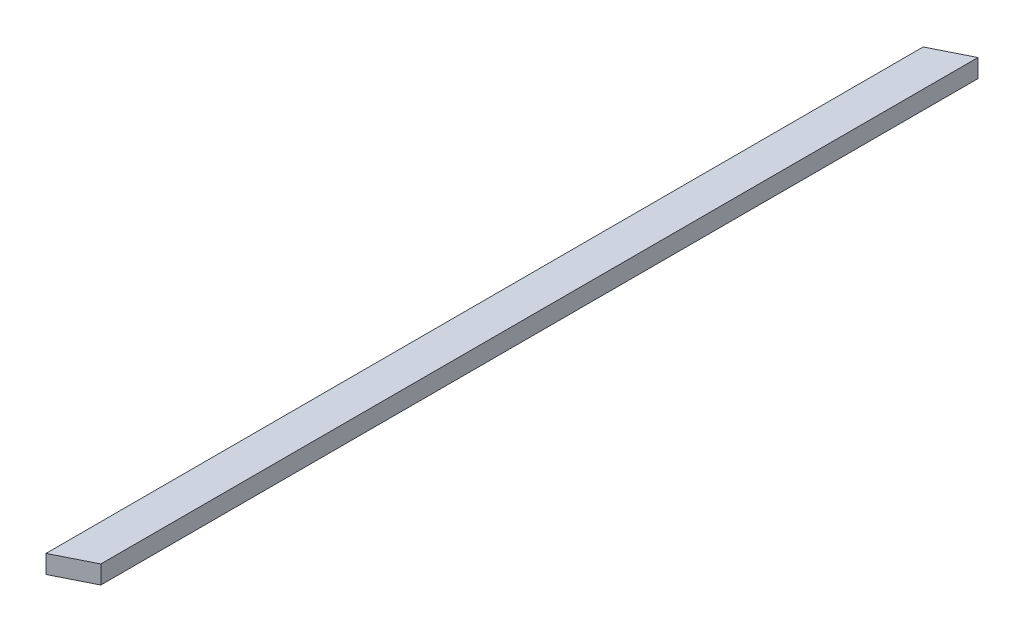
ISO-10303-21;
HEADER;
FILE_DESCRIPTION(('STEP AP214'),'2;1');
FILE_NAME('part.step','',(''),(''),'','','');
FILE_SCHEMA(('AUTOMOTIVE_DESIGN { 1 0 10303 214 1 1 1 1 }'));
ENDSEC;
DATA;
#1=APPLICATION_CONTEXT('core data for automotive mechanical design processes');
#2=APPLICATION_PROTOCOL_DEFINITION('international standard','automotive_design',2000,#1);
#3=PRODUCT_CONTEXT('',#1,'mechanical');
#4=PRODUCT('Part','Part','',(#3));
#5=PRODUCT_RELATED_PRODUCT_CATEGORY('part','',(#4));
#6=PRODUCT_DEFINITION_FORMATION('','',#4);
#7=PRODUCT_DEFINITION_CONTEXT('part definition',#1,'design');
#8=PRODUCT_DEFINITION('design','',#6,#7);
#9=PRODUCT_DEFINITION_SHAPE('','',#8);
#10=(LENGTH_UNIT() NAMED_UNIT(*) SI_UNIT(.MILLI.,.METRE.));
#11=(NAMED_UNIT(*) PLANE_ANGLE_UNIT() SI_UNIT($,.RADIAN.));
#12=(NAMED_UNIT(*) SI_UNIT($,.STERADIAN.) SOLID_ANGLE_UNIT());
#13=UNCERTAINTY_MEASURE_WITH_UNIT(LENGTH_MEASURE(1.E-05),#10,'distance_accuracy_value','');
#14=(GEOMETRIC_REPRESENTATION_CONTEXT(3) GLOBAL_UNCERTAINTY_ASSIGNED_CONTEXT((#13)) GLOBAL_UNIT_ASSIGNED_CONTEXT((#10,
#11,#12)) REPRESENTATION_CONTEXT('',''));
#15=CARTESIAN_POINT('',(0.,0.,0.));
#16=DIRECTION('',(0.,0.,1.));
#17=DIRECTION('',(1.,0.,0.));
#18=AXIS2_PLACEMENT_3D('',#15,#16,#17);
#19=CARTESIAN_POINT('',(-101.6,50.8,50.8109698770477));
#20=DIRECTION('',(0.447290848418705,0.,0.894388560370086));
#21=DIRECTION('',(0.894388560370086,0.,-0.447290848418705));
#22=AXIS2_PLACEMENT_3D('',#19,#20,#21);
#23=PLANE('',#22);
#24=DIRECTION('',(-0.894388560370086,0.,0.447290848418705));
#25=VECTOR('',#24,1.);
#26=CARTESIAN_POINT('',(-101.6,0.,50.8109698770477));
#27=LINE('',#26,#25);
#28=CARTESIAN_POINT('',(0.,0.,0.));
#29=VERTEX_POINT('',#28);
#30=CARTESIAN_POINT('',(-101.6,0.,50.8109698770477));
#31=VERTEX_POINT('',#30);
#32=EDGE_CURVE('E96',#29,#31,#27,.T.);
#33=ORIENTED_EDGE('',*,*,#32,.T.);
#34=DIRECTION('',(0.,-1.,0.));
#35=VECTOR('',#34,1.);
#36=CARTESIAN_POINT('',(-101.6,50.8,50.8109698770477));
#37=LINE('',#36,#35);
#38=CARTESIAN_POINT('',(-101.6,50.8,50.8109698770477));
#39=VERTEX_POINT('',#38);
#40=EDGE_CURVE('E11',#39,#31,#37,.T.);
#41=ORIENTED_EDGE('',*,*,#40,.F.);
#42=DIRECTION('',(-0.894388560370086,0.,0.447290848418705));
#43=VECTOR('',#42,1.);
#44=CARTESIAN_POINT('',(-101.6,50.8,50.8109698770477));
#45=LINE('',#44,#43);
#46=CARTESIAN_POINT('',(0.,50.8,0.));
#47=VERTEX_POINT('',#46);
#48=EDGE_CURVE('E84',#47,#39,#45,.T.);
#49=ORIENTED_EDGE('',*,*,#48,.F.);
#50=DIRECTION('',(0.,-1.,0.));
#51=VECTOR('',#50,1.);
#52=CARTESIAN_POINT('',(0.,50.8,0.));
#53=LINE('',#52,#51);
#54=EDGE_CURVE('E92',#47,#29,#53,.T.);
#55=ORIENTED_EDGE('',*,*,#54,.T.);
#56=EDGE_LOOP('',(#33,#41,#49,#55));
#57=FACE_BOUND('',#56,.T.);
#58=ADVANCED_FACE('F33',(#57),#23,.F.);
#59=CARTESIAN_POINT('',(-101.6,50.8,2489.21096987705));
#60=DIRECTION('',(1.,0.,0.));
#61=DIRECTION('',(0.,0.,-1.));
#62=AXIS2_PLACEMENT_3D('',#59,#60,#61);
#63=PLANE('',#62);
#64=DIRECTION('',(0.,0.,1.));
#65=VECTOR('',#64,1.);
#66=CARTESIAN_POINT('',(-101.6,0.,2489.21096987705));
#67=LINE('',#66,#65);
#68=CARTESIAN_POINT('',(-101.6,0.,2489.21096987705));
#69=VERTEX_POINT('',#68);
#70=EDGE_CURVE('E88',#31,#69,#67,.T.);
#71=ORIENTED_EDGE('',*,*,#70,.T.);
#72=DIRECTION('',(0.,-1.,0.));
#73=VECTOR('',#72,1.);
#74=CARTESIAN_POINT('',(-101.6,50.8,2489.21096987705));
#75=LINE('',#74,#73);
#76=CARTESIAN_POINT('',(-101.6,50.8,2489.21096987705));
#77=VERTEX_POINT('',#76);
#78=EDGE_CURVE('E41',#77,#69,#75,.T.);
#79=ORIENTED_EDGE('',*,*,#78,.F.);
#80=DIRECTION('',(0.,0.,1.));
#81=VECTOR('',#80,1.);
#82=CARTESIAN_POINT('',(-101.6,50.8,2489.21096987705));
#83=LINE('',#82,#81);
#84=EDGE_CURVE('E79',#39,#77,#83,.T.);
#85=ORIENTED_EDGE('',*,*,#84,.F.);
#86=ORIENTED_EDGE('',*,*,#40,.T.);
#87=EDGE_LOOP('',(#71,#79,#85,#86));
#88=FACE_BOUND('',#87,.T.);
#89=ADVANCED_FACE('F87',(#88),#63,.F.);
#90=CARTESIAN_POINT('',(2.9861787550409E-13,50.8,2438.4));
#91=DIRECTION('',(-0.447290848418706,0.,-0.894388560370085));
#92=DIRECTION('',(-0.894388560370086,0.,0.447290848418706));
#93=AXIS2_PLACEMENT_3D('',#90,#91,#92);
#94=PLANE('',#93);
#95=DIRECTION('',(0.894388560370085,0.,-0.447290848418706));
#96=VECTOR('',#95,1.);
#97=CARTESIAN_POINT('',(2.9861787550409E-13,0.,2438.4));
#98=LINE('',#97,#96);
#99=CARTESIAN_POINT('',(2.9861787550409E-13,0.,2438.4));
#100=VERTEX_POINT('',#99);
#101=EDGE_CURVE('E66',#69,#100,#98,.T.);
#102=ORIENTED_EDGE('',*,*,#101,.T.);
#103=DIRECTION('',(0.,-1.,0.));
#104=VECTOR('',#103,1.);
#105=CARTESIAN_POINT('',(2.9861787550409E-13,50.8,2438.4));
#106=LINE('',#105,#104);
#107=CARTESIAN_POINT('',(2.9861787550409E-13,50.8,2438.4));
#108=VERTEX_POINT('',#107);
#109=EDGE_CURVE('E89',#108,#100,#106,.T.);
#110=ORIENTED_EDGE('',*,*,#109,.F.);
#111=DIRECTION('',(0.894388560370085,0.,-0.447290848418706));
#112=VECTOR('',#111,1.);
#113=CARTESIAN_POINT('',(2.9861787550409E-13,50.8,2438.4));
#114=LINE('',#113,#112);
#115=EDGE_CURVE('E82',#77,#108,#114,.T.);
#116=ORIENTED_EDGE('',*,*,#115,.F.);
#117=ORIENTED_EDGE('',*,*,#78,.T.);
#118=EDGE_LOOP('',(#102,#110,#116,#117));
#119=FACE_BOUND('',#118,.T.);
#120=ADVANCED_FACE('F90',(#119),#94,.F.);
#121=CARTESIAN_POINT('',(0.,50.8,0.));
#122=DIRECTION('',(-1.,0.,0.));
#123=DIRECTION('',(0.,0.,1.));
#124=AXIS2_PLACEMENT_3D('',#121,#122,#123);
#125=PLANE('',#124);
#126=DIRECTION('',(0.,0.,-1.));
#127=VECTOR('',#126,1.);
#128=CARTESIAN_POINT('',(0.,0.,0.));
#129=LINE('',#128,#127);
#130=EDGE_CURVE('E72',#100,#29,#129,.T.);
#131=ORIENTED_EDGE('',*,*,#130,.T.);
#132=ORIENTED_EDGE('',*,*,#54,.F.);
#133=DIRECTION('',(0.,0.,-1.));
#134=VECTOR('',#133,1.);
#135=CARTESIAN_POINT('',(0.,50.8,0.));
#136=LINE('',#135,#134);
#137=EDGE_CURVE('E49',#108,#47,#136,.T.);
#138=ORIENTED_EDGE('',*,*,#137,.F.);
#139=ORIENTED_EDGE('',*,*,#109,.T.);
#140=EDGE_LOOP('',(#131,#132,#138,#139));
#141=FACE_BOUND('',#140,.T.);
#142=ADVANCED_FACE('F103',(#141),#125,.F.);
#143=CARTESIAN_POINT('',(0.,50.8,0.));
#144=DIRECTION('',(0.,-1.,0.));
#145=DIRECTION('',(0.,0.,-1.));
#146=AXIS2_PLACEMENT_3D('',#143,#144,#145);
#147=PLANE('',#146);
#148=ORIENTED_EDGE('',*,*,#48,.T.);
#149=ORIENTED_EDGE('',*,*,#84,.T.);
#150=ORIENTED_EDGE('',*,*,#115,.T.);
#151=ORIENTED_EDGE('',*,*,#137,.T.);
#152=EDGE_LOOP('',(#148,#149,#150,#151));
#153=FACE_BOUND('',#152,.T.);
#154=ADVANCED_FACE('F80',(#153),#147,.F.);
#155=CARTESIAN_POINT('',(0.,0.,0.));
#156=DIRECTION('',(0.,-1.,0.));
#157=DIRECTION('',(0.,0.,-1.));
#158=AXIS2_PLACEMENT_3D('',#155,#156,#157);
#159=PLANE('',#158);
#160=ORIENTED_EDGE('',*,*,#32,.F.);
#161=ORIENTED_EDGE('',*,*,#130,.F.);
#162=ORIENTED_EDGE('',*,*,#101,.F.);
#163=ORIENTED_EDGE('',*,*,#70,.F.);
#164=EDGE_LOOP('',(#160,#161,#162,#163));
#165=FACE_BOUND('',#164,.T.);
#166=ADVANCED_FACE('F106',(#165),#159,.T.);
#167=CLOSED_SHELL('',(#58,#89,#120,#142,#154,#166));
#168=MANIFOLD_SOLID_BREP('B2',#167);
#169=ADVANCED_BREP_SHAPE_REPRESENTATION('',(#18,#168),#14);
#170=SHAPE_DEFINITION_REPRESENTATION(#9,#169);
ENDSEC;
END-ISO-10303-21;
